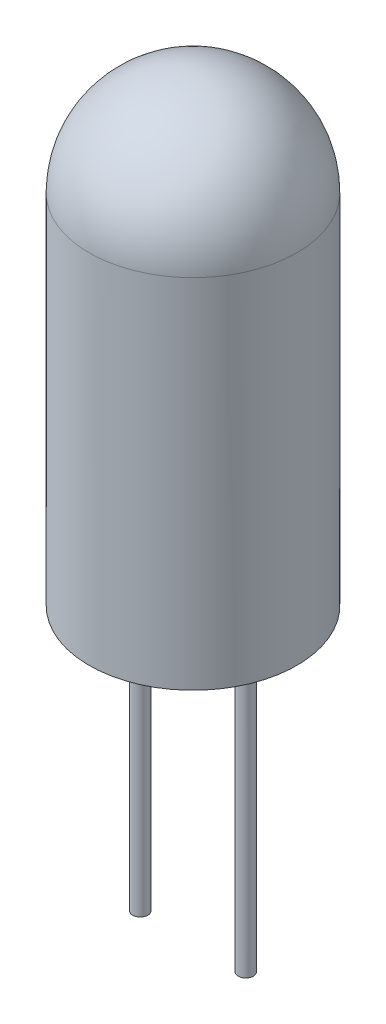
from build123d import *

# Parameters (mm, degrees)
SKETCH2_R           = 0.182921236
BOSS_EXTRUDE1_DEPTH = 7


with BuildPart() as part:
    # Sketch1 → Revolve3 (revolve)
    with BuildSketch(Plane.XY):
        with BuildLine():
            Line((2.5, 0), (2.5, -8.6))
            Line((2.5, -8.6), (0, -8.6))
            Line((0, -8.6), (0, 2.5))
            ThreePointArc((0, 2.5), (1.767766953, 1.767766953), (2.5, 0))
        make_face()
    revolve(axis=Axis((0, 2.5, 0), (0, -1, 0)))

    # Sketch2 → Boss-Extrude1 (add)
    with BuildSketch(Plane.XZ.offset(8.6)):
        with Locations(Location((1.27, 0, 0), (0, 0, 180))):
            Circle(SKETCH2_R)
        with Locations(Location((-1.27, 0, 0), (0, 0, 180))):
            Circle(SKETCH2_R)
    extrude(amount=BOSS_EXTRUDE1_DEPTH)


solid = part.part
